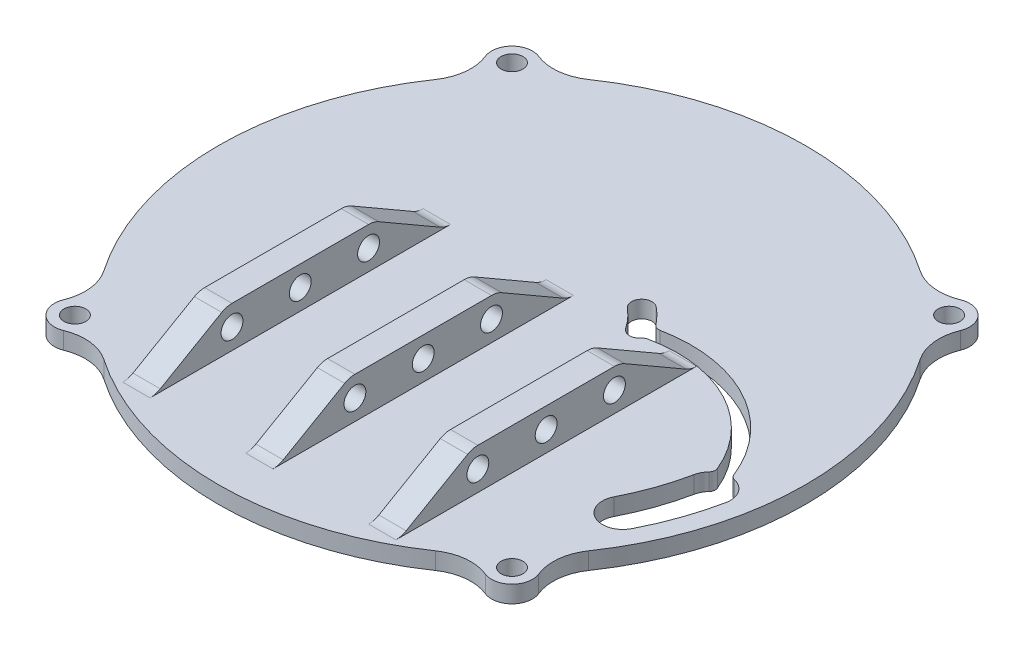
from build123d import *

# Parameters (mm, degrees)
SKETCH_1_R               = 1.6
EXTRUDE_1_DEPTH          = 4
SKETCH_2_R               = 50
CUT_EXTRUDE_1_DEPTH      = 1.5
CUT_EXTRUDE_2_DEPTH      = 61.862550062
SKETCH_6_R               = 1.6
EXTRUDE_2_DEPTH          = 20
SKETCH_7_W               = 14
SKETCH_7_H               = 42.392304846
CUT_EXTRUDE_3_DEPTH      = 6
FILLET_1_R               = 3
CUT_EXTRUDE_4_DEPTH      = 62.10646447
CUT_EXTRUDE_4_DEPTH_BACK = 62.10646447
FILLET_2_R               = 1


with BuildPart() as part:
    # Sketch 1 → Extrude 1 (new body)
    with BuildSketch(Plane(origin=(0, 0, 0), x_dir=(1, 0, 0), z_dir=(0, 1, 0))):
        with BuildLine():
            ThreePointArc((-34.779322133, 30.870677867), (-34.121320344, 34.121320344), (-30.870677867, 34.779322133))
            ThreePointArc((-30.870677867, 34.779322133), (-27.487559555, 34.304490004), (-24.282609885, 35.487390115))
            ThreePointArc((-24.282609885, 35.487390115), (0, 43), (24.282609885, 35.487390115))
            ThreePointArc((24.282609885, 35.487390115), (27.487559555, 34.304490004), (30.870677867, 34.779322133))
            ThreePointArc((30.870677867, 34.779322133), (34.121320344, 34.121320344), (34.779322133, 30.870677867))
            ThreePointArc((34.779322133, 30.870677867), (34.304490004, 27.487559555), (35.487390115, 24.282609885))
            ThreePointArc((35.487390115, 24.282609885), (43, 0), (35.487390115, -24.282609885))
            ThreePointArc((35.487390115, -24.282609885), (34.304490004, -27.487559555), (34.779322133, -30.870677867))
            ThreePointArc((34.779322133, -30.870677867), (34.121320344, -34.121320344), (30.870677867, -34.779322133))
            ThreePointArc((30.870677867, -34.779322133), (27.487559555, -34.304490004), (24.282609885, -35.487390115))
            ThreePointArc((24.282609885, -35.487390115), (0, -43), (-24.282609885, -35.487390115))
            ThreePointArc((-24.282609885, -35.487390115), (-27.487559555, -34.304490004), (-30.870677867, -34.779322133))
            ThreePointArc((-30.870677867, -34.779322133), (-34.121320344, -34.121320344), (-34.779322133, -30.870677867))
            ThreePointArc((-34.779322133, -30.870677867), (-34.304490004, -27.487559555), (-35.487390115, -24.282609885))
            ThreePointArc((-35.487390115, -24.282609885), (-43, 0), (-35.487390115, 24.282609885))
            ThreePointArc((-35.487390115, 24.282609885), (-34.304490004, 27.487559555), (-34.779322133, 30.870677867))
        make_face()
        with Locations(Location((-32, 32, 0), (0, 0, 270))):
            Circle(SKETCH_1_R, mode=Mode.SUBTRACT)
        with Locations(Location((32, 32, 0), (0, 0, 270))):
            Circle(SKETCH_1_R, mode=Mode.SUBTRACT)
        with Locations(Location((32, -32, 0), (0, 0, 270))):
            Circle(SKETCH_1_R, mode=Mode.SUBTRACT)
        with Locations(Location((-32, -32, 0), (0, 0, 270))):
            Circle(SKETCH_1_R, mode=Mode.SUBTRACT)
    extrude(amount=EXTRUDE_1_DEPTH)

    # Sketch 2 → Cut-Extrude 1 (cut)
    with BuildSketch(Plane(origin=(0, 4, 0), x_dir=(1, 0, 0), z_dir=(0, 1, 0))):
        Circle(SKETCH_2_R)
    extrude(amount=-CUT_EXTRUDE_1_DEPTH, mode=Mode.SUBTRACT)

    # Sketch 4 → Cut-Extrude 2 (cut, through all)
    with BuildSketch(Plane(origin=(0, 2.5, 0), x_dir=(1, 0, 0), z_dir=(0, 1, 0))):
        with BuildLine():
            ThreePointArc((12.472191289, 8.333333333), (11.099994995, 10.089108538), (9.482825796, 11.622220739))
            ThreePointArc((9.482825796, 11.622220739), (7.372321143, 11.408281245), (7.586260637, 9.297776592))
            ThreePointArc((7.586260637, 9.297776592), (8.879995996, 8.071286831), (9.977753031, 6.666666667))
            ThreePointArc((9.977753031, 6.666666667), (12.058305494, 6.252780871), (12.472191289, 8.333333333))
        make_face()
        with BuildLine():
            ThreePointArc((35.849145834, -18.300307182), (37.981144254, -13.322731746), (39.425718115, -8.104026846))
            ThreePointArc((39.425718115, -8.104026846), (37.09118212, -4.561437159), (33.548592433, -6.895973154))
            ThreePointArc((33.548592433, -6.895973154), (32.319358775, -11.336734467), (30.505173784, -15.57231108))
            ThreePointArc((30.505173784, -15.57231108), (31.813161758, -19.608295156), (35.849145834, -18.300307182))
        make_face()
    extrude(amount=-CUT_EXTRUDE_2_DEPTH, mode=Mode.SUBTRACT)

    # Sketch 6 → Extrude 2 (add, symmetric)
    with BuildSketch(Plane(origin=(0, 0, 0), x_dir=(0, 0, -1), z_dir=(1, 0, 0))):
        Polygon((-36.196152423, 2.5), (-25.803847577, 8.5), (-4.196152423, 8.5), (6.196152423, 2.5), align=None)
        with Locations((-25, 5.5)):
            Circle(SKETCH_6_R, mode=Mode.SUBTRACT)
        with Locations((-15, 5.5)):
            Circle(SKETCH_6_R, mode=Mode.SUBTRACT)
        with Locations((-5, 5.5)):
            Circle(SKETCH_6_R, mode=Mode.SUBTRACT)
    extrude(amount=EXTRUDE_2_DEPTH, both=True)

    # Sketch 7 → Cut-Extrude 3 (cut)
    with BuildSketch(Plane(origin=(0, 8.5, 0), x_dir=(1, 0, 0), z_dir=(0, 1, 0))):
        with Locations((-9, -15)):
            Rectangle(SKETCH_7_W, SKETCH_7_H)
        with Locations((9, -15)):
            Rectangle(SKETCH_7_W, SKETCH_7_H)
    extrude(amount=-CUT_EXTRUDE_3_DEPTH, mode=Mode.SUBTRACT)

    # Fillet 1
    fillet_1_edges = [part.edges().sort_by_distance(p)[0] for p in [
        (18, 2.5, 36.196152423),
        (18, 2.5, -6.196152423),
        (18, 8.5, 4.196152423),
        (18, 8.5, 25.803847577),
        (0, 2.5, 36.196152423),
        (-18, 2.5, 36.196152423),
        (0, 8.5, 25.803847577),
        (-18, 8.5, 25.803847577),
        (0, 8.5, 4.196152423),
        (-18, 8.5, 4.196152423),
        (0, 2.5, -6.196152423),
        (-18, 2.5, -6.196152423),
    ]]
    fillet(fillet_1_edges, radius=FILLET_1_R)

    # Sketch 8 → Cut-Extrude 4 (cut, two sides: drawn at the far end of the back side and taken through both)
    with BuildSketch(Plane(origin=(0, 2.5, 0), x_dir=(1, 0, 0), z_dir=(0, 1, 0)).offset(-CUT_EXTRUDE_4_DEPTH_BACK)):
        with BuildLine():
            ThreePointArc((37.465177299, -7.291498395), (27.648334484, 6.386735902), (10.939885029, 8.458501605))
            ThreePointArc((10.939885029, 8.458501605), (10.266470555, 7.214912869), (11.510059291, 6.541498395))
            ThreePointArc((11.510059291, 6.541498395), (26.627227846, 4.66704371), (35.50913325, -7.708501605))
            ThreePointArc((35.50913325, -7.708501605), (36.69565688, -8.478022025), (37.465177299, -7.291498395))
        make_face()
    extrude(amount=CUT_EXTRUDE_4_DEPTH + CUT_EXTRUDE_4_DEPTH_BACK, mode=Mode.SUBTRACT)

    # Fillet 2
    fillet_2_edges = [part.edges().sort_by_distance(p)[0] for p in [
        (12.160491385, 1.25, -8.781938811),
        (12.563041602, 1.25, -6.822083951),
        (36.666718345, 1.25, 4.505378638),
        (34.740244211, 1.25, 5.061085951),
    ]]
    fillet(fillet_2_edges, radius=FILLET_2_R)


solid = part.part
